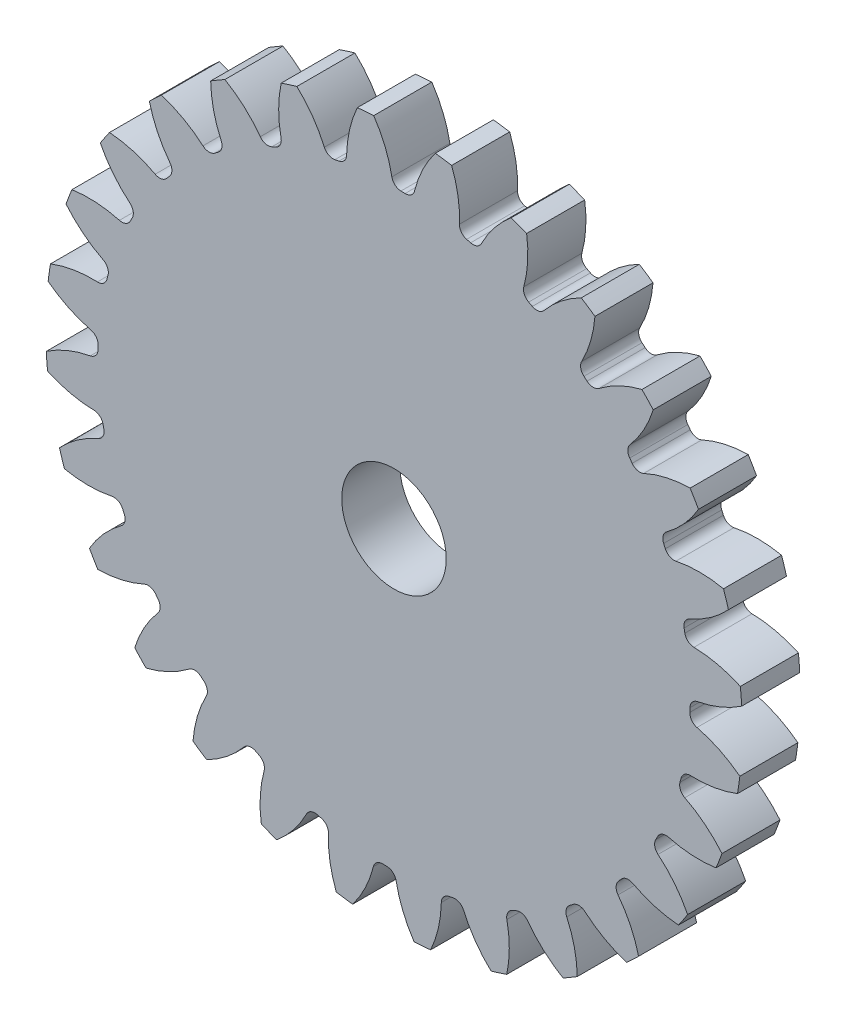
from build123d import *

# Parameters (mm, degrees)
SKETCH3_R         = 762
GEARBODY_DEPTH    = 127
TOOTHCUT_DEPTH    = 1086.088475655
CIRPATTERN1_COUNT = 28
BOREDIA_R         = 114.3
BORE_DEPTH        = 12700


with BuildPart() as part:
    # Sketch3 → gearBody (new body)
    with BuildSketch(Plane.XY):
        Circle(SKETCH3_R)
    extrude(amount=GEARBODY_DEPTH)

    # Sketch2 → toothCut (cut, through all)
    with BuildSketch(Plane.XY):
        with BuildLine():
            ThreePointArc((647.246394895, -24.236218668), (647.399755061, -19.719207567), (647.521592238, -15.201236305))
            ThreePointArc((647.521592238, -15.201236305), (652.440834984, -2.292564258), (664.391375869, 4.63688996))
            ThreePointArc((664.391375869, 4.63688996), (715.311853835, 19.777361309), (762, 45.121906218))
            ThreePointArc((762, 45.121906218), (762.980931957, -23.239705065), (757.841213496, -91.414886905))
            ThreePointArc((757.841213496, -91.414886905), (712.782129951, -63.275804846), (662.877523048, -45.064293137))
            ThreePointArc((662.877523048, -45.064293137), (651.370874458, -37.420354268), (647.246394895, -24.236218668))
        make_face()
    toothcut = extrude(amount=TOOTHCUT_DEPTH, mode=Mode.SUBTRACT)

    # CirPattern1: toothCut ×28 about axis
    cirpattern1_axis = Axis((0, 0, 0), (0, 0, 1))
    for i in range(1, CIRPATTERN1_COUNT):
        add(toothcut.rotate(cirpattern1_axis, i * 360 / CIRPATTERN1_COUNT), mode=Mode.SUBTRACT)

    # boreDia → bore (cut, symmetric)
    with BuildSketch(Plane.XY):
        Circle(BOREDIA_R)
    extrude(amount=BORE_DEPTH, both=True, mode=Mode.SUBTRACT)


solid = part.part
